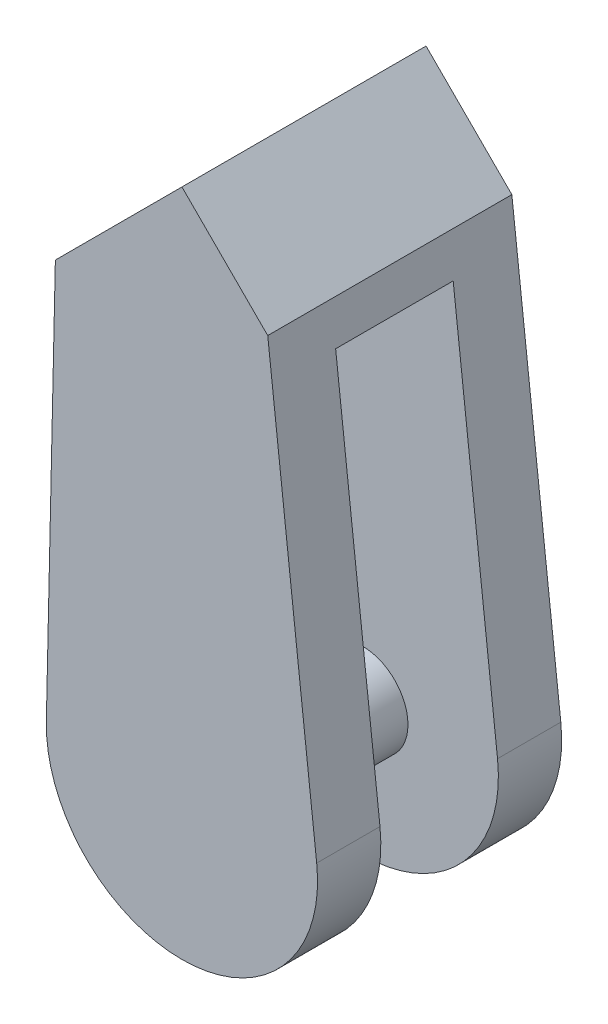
ISO-10303-21;
HEADER;
FILE_DESCRIPTION(('STEP AP214'),'2;1');
FILE_NAME('part.step','',(''),(''),'','','');
FILE_SCHEMA(('AUTOMOTIVE_DESIGN { 1 0 10303 214 1 1 1 1 }'));
ENDSEC;
DATA;
#1=APPLICATION_CONTEXT('core data for automotive mechanical design processes');
#2=APPLICATION_PROTOCOL_DEFINITION('international standard','automotive_design',2000,#1);
#3=PRODUCT_CONTEXT('',#1,'mechanical');
#4=PRODUCT('Part','Part','',(#3));
#5=PRODUCT_RELATED_PRODUCT_CATEGORY('part','',(#4));
#6=PRODUCT_DEFINITION_FORMATION('','',#4);
#7=PRODUCT_DEFINITION_CONTEXT('part definition',#1,'design');
#8=PRODUCT_DEFINITION('design','',#6,#7);
#9=PRODUCT_DEFINITION_SHAPE('','',#8);
#10=(LENGTH_UNIT() NAMED_UNIT(*) SI_UNIT(.MILLI.,.METRE.));
#11=(NAMED_UNIT(*) PLANE_ANGLE_UNIT() SI_UNIT($,.RADIAN.));
#12=(NAMED_UNIT(*) SI_UNIT($,.STERADIAN.) SOLID_ANGLE_UNIT());
#13=UNCERTAINTY_MEASURE_WITH_UNIT(LENGTH_MEASURE(1.E-05),#10,'distance_accuracy_value','');
#14=(GEOMETRIC_REPRESENTATION_CONTEXT(3) GLOBAL_UNCERTAINTY_ASSIGNED_CONTEXT((#13)) GLOBAL_UNIT_ASSIGNED_CONTEXT((#10,
#11,#12)) REPRESENTATION_CONTEXT('',''));
#15=CARTESIAN_POINT('',(0.,0.,0.));
#16=DIRECTION('',(0.,0.,1.));
#17=DIRECTION('',(1.,0.,0.));
#18=AXIS2_PLACEMENT_3D('',#15,#16,#17);
#19=CARTESIAN_POINT('',(-10.,-15.5,-0.65));
#20=DIRECTION('',(0.,0.,1.));
#21=DIRECTION('',(1.,0.,0.));
#22=AXIS2_PLACEMENT_3D('',#19,#20,#21);
#23=PLANE('',#22);
#24=DIRECTION('',(-0.0222995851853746,-0.999751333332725,0.));
#25=VECTOR('',#24,1.);
#26=CARTESIAN_POINT('',(-1.4,4.5,-0.65));
#27=LINE('',#26,#25);
#28=CARTESIAN_POINT('',(-1.4,4.5,-0.65));
#29=VERTEX_POINT('',#28);
#30=CARTESIAN_POINT('',(-1.49962699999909,0.0334493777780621,-0.65));
#31=VERTEX_POINT('',#30);
#32=EDGE_CURVE('E133',#29,#31,#27,.T.);
#33=ORIENTED_EDGE('',*,*,#32,.T.);
#34=CARTESIAN_POINT('',(0.,0.,-0.65));
#35=DIRECTION('',(0.,0.,1.));
#36=DIRECTION('',(1.,0.,0.));
#37=AXIS2_PLACEMENT_3D('',#34,#35,#36);
#38=CIRCLE('',#37,1.5);
#39=CARTESIAN_POINT('',(1.49047378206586,0.168783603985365,-0.65));
#40=VERTEX_POINT('',#39);
#41=EDGE_CURVE('E109',#31,#40,#38,.T.);
#42=ORIENTED_EDGE('',*,*,#41,.T.);
#43=DIRECTION('',(-0.11252240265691,0.993649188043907,0.));
#44=VECTOR('',#43,1.);
#45=CARTESIAN_POINT('',(0.999999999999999,4.5,-0.65));
#46=LINE('',#45,#44);
#47=CARTESIAN_POINT('',(0.999999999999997,4.5,-0.65));
#48=VERTEX_POINT('',#47);
#49=EDGE_CURVE('E37',#40,#48,#46,.T.);
#50=ORIENTED_EDGE('',*,*,#49,.T.);
#51=DIRECTION('',(-1.,0.,0.));
#52=VECTOR('',#51,1.);
#53=CARTESIAN_POINT('',(-10.,4.5,-0.65));
#54=LINE('',#53,#52);
#55=EDGE_CURVE('E120',#48,#29,#54,.T.);
#56=ORIENTED_EDGE('',*,*,#55,.T.);
#57=EDGE_LOOP('',(#33,#42,#50,#56));
#58=FACE_BOUND('',#57,.T.);
#59=CARTESIAN_POINT('',(0.,0.,-0.65));
#60=DIRECTION('',(0.,0.,1.));
#61=DIRECTION('',(1.,0.,0.));
#62=AXIS2_PLACEMENT_3D('',#59,#60,#61);
#63=CIRCLE('',#62,0.5);
#64=CARTESIAN_POINT('',(0.5,0.,-0.65));
#65=VERTEX_POINT('',#64);
#66=EDGE_CURVE('E121',#65,#65,#63,.F.);
#67=ORIENTED_EDGE('',*,*,#66,.T.);
#68=EDGE_LOOP('',(#67));
#69=FACE_BOUND('',#68,.T.);
#70=ADVANCED_FACE('F29',(#58,#69),#23,.T.);
#71=CARTESIAN_POINT('',(-10.,-15.5,0.65));
#72=DIRECTION('',(0.,0.,1.));
#73=DIRECTION('',(1.,0.,0.));
#74=AXIS2_PLACEMENT_3D('',#71,#72,#73);
#75=PLANE('',#74);
#76=DIRECTION('',(-1.,0.,0.));
#77=VECTOR('',#76,1.);
#78=CARTESIAN_POINT('',(-10.,4.5,0.65));
#79=LINE('',#78,#77);
#80=CARTESIAN_POINT('',(0.999999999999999,4.5,0.65));
#81=VERTEX_POINT('',#80);
#82=CARTESIAN_POINT('',(-1.4,4.5,0.65));
#83=VERTEX_POINT('',#82);
#84=EDGE_CURVE('E44',#81,#83,#79,.T.);
#85=ORIENTED_EDGE('',*,*,#84,.F.);
#86=DIRECTION('',(-0.11252240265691,0.993649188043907,0.));
#87=VECTOR('',#86,1.);
#88=CARTESIAN_POINT('',(0.999999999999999,4.5,0.65));
#89=LINE('',#88,#87);
#90=CARTESIAN_POINT('',(1.49047378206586,0.168783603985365,0.65));
#91=VERTEX_POINT('',#90);
#92=EDGE_CURVE('E148',#91,#81,#89,.T.);
#93=ORIENTED_EDGE('',*,*,#92,.F.);
#94=CARTESIAN_POINT('',(0.,0.,0.65));
#95=DIRECTION('',(0.,0.,1.));
#96=DIRECTION('',(1.,0.,0.));
#97=AXIS2_PLACEMENT_3D('',#94,#95,#96);
#98=CIRCLE('',#97,1.5);
#99=CARTESIAN_POINT('',(-1.49962699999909,0.0334493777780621,0.65));
#100=VERTEX_POINT('',#99);
#101=EDGE_CURVE('E104',#100,#91,#98,.T.);
#102=ORIENTED_EDGE('',*,*,#101,.F.);
#103=DIRECTION('',(-0.0222995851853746,-0.999751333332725,0.));
#104=VECTOR('',#103,1.);
#105=CARTESIAN_POINT('',(-1.4,4.5,0.65));
#106=LINE('',#105,#104);
#107=EDGE_CURVE('E100',#83,#100,#106,.T.);
#108=ORIENTED_EDGE('',*,*,#107,.F.);
#109=EDGE_LOOP('',(#85,#93,#102,#108));
#110=FACE_BOUND('',#109,.T.);
#111=CARTESIAN_POINT('',(0.,0.,0.65));
#112=DIRECTION('',(0.,0.,1.));
#113=DIRECTION('',(1.,0.,0.));
#114=AXIS2_PLACEMENT_3D('',#111,#112,#113);
#115=CIRCLE('',#114,0.5);
#116=CARTESIAN_POINT('',(0.5,0.,0.65));
#117=VERTEX_POINT('',#116);
#118=EDGE_CURVE('E11',#117,#117,#115,.F.);
#119=ORIENTED_EDGE('',*,*,#118,.F.);
#120=EDGE_LOOP('',(#119));
#121=FACE_BOUND('',#120,.T.);
#122=ADVANCED_FACE('F101',(#110,#121),#75,.F.);
#123=CARTESIAN_POINT('',(-1.4,4.5,1.35));
#124=DIRECTION('',(0.999751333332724,-0.0222995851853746,0.));
#125=DIRECTION('',(0.0222995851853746,0.999751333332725,0.));
#126=AXIS2_PLACEMENT_3D('',#123,#124,#125);
#127=PLANE('',#126);
#128=ORIENTED_EDGE('',*,*,#32,.F.);
#129=DIRECTION('',(0.,0.,-1.));
#130=VECTOR('',#129,1.);
#131=CARTESIAN_POINT('',(-1.4,4.5,1.35));
#132=LINE('',#131,#130);
#133=CARTESIAN_POINT('',(-1.4,4.5,-1.35));
#134=VERTEX_POINT('',#133);
#135=EDGE_CURVE('E131',#29,#134,#132,.T.);
#136=ORIENTED_EDGE('',*,*,#135,.T.);
#137=DIRECTION('',(-0.0222995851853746,-0.999751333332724,0.));
#138=VECTOR('',#137,1.);
#139=CARTESIAN_POINT('',(-1.4,4.5,-1.35));
#140=LINE('',#139,#138);
#141=CARTESIAN_POINT('',(-1.49962699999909,0.0334493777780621,-1.35));
#142=VERTEX_POINT('',#141);
#143=EDGE_CURVE('E170',#134,#142,#140,.T.);
#144=ORIENTED_EDGE('',*,*,#143,.T.);
#145=DIRECTION('',(0.,0.,-1.));
#146=VECTOR('',#145,1.);
#147=CARTESIAN_POINT('',(-1.49962699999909,0.0334493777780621,1.35));
#148=LINE('',#147,#146);
#149=EDGE_CURVE('E186',#31,#142,#148,.T.);
#150=ORIENTED_EDGE('',*,*,#149,.F.);
#151=EDGE_LOOP('',(#128,#136,#144,#150));
#152=FACE_BOUND('',#151,.T.);
#153=ADVANCED_FACE('F202',(#152),#127,.F.);
#154=CARTESIAN_POINT('',(0.,0.,1.35));
#155=DIRECTION('',(0.,0.,-1.));
#156=DIRECTION('',(-1.,0.,0.));
#157=AXIS2_PLACEMENT_3D('',#154,#155,#156);
#158=CYLINDRICAL_SURFACE('',#157,1.5);
#159=ORIENTED_EDGE('',*,*,#41,.F.);
#160=ORIENTED_EDGE('',*,*,#149,.T.);
#161=CARTESIAN_POINT('',(0.,0.,-1.35));
#162=DIRECTION('',(0.,0.,1.));
#163=DIRECTION('',(1.,0.,0.));
#164=AXIS2_PLACEMENT_3D('',#161,#162,#163);
#165=CIRCLE('',#164,1.5);
#166=CARTESIAN_POINT('',(1.49047378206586,0.168783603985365,-1.35));
#167=VERTEX_POINT('',#166);
#168=EDGE_CURVE('E173',#142,#167,#165,.T.);
#169=ORIENTED_EDGE('',*,*,#168,.T.);
#170=DIRECTION('',(0.,0.,-1.));
#171=VECTOR('',#170,1.);
#172=CARTESIAN_POINT('',(1.49047378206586,0.168783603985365,1.35));
#173=LINE('',#172,#171);
#174=EDGE_CURVE('E185',#40,#167,#173,.T.);
#175=ORIENTED_EDGE('',*,*,#174,.F.);
#176=EDGE_LOOP('',(#159,#160,#169,#175));
#177=FACE_BOUND('',#176,.T.);
#178=ADVANCED_FACE('F191',(#177),#158,.T.);
#179=CARTESIAN_POINT('',(0.999999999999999,4.5,1.35));
#180=DIRECTION('',(-0.993649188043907,-0.11252240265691,0.));
#181=DIRECTION('',(0.11252240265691,-0.993649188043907,0.));
#182=AXIS2_PLACEMENT_3D('',#179,#180,#181);
#183=PLANE('',#182);
#184=ORIENTED_EDGE('',*,*,#49,.F.);
#185=ORIENTED_EDGE('',*,*,#174,.T.);
#186=DIRECTION('',(-0.11252240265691,0.993649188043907,0.));
#187=VECTOR('',#186,1.);
#188=CARTESIAN_POINT('',(0.999999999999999,4.5,-1.35));
#189=LINE('',#188,#187);
#190=CARTESIAN_POINT('',(0.948918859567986,4.95108114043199,-1.35));
#191=VERTEX_POINT('',#190);
#192=EDGE_CURVE('E176',#167,#191,#189,.T.);
#193=ORIENTED_EDGE('',*,*,#192,.T.);
#194=DIRECTION('',(0.,0.,-1.));
#195=VECTOR('',#194,1.);
#196=CARTESIAN_POINT('',(0.948918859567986,4.95108114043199,1.35));
#197=LINE('',#196,#195);
#198=CARTESIAN_POINT('',(0.948918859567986,4.95108114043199,1.35));
#199=VERTEX_POINT('',#198);
#200=EDGE_CURVE('E140',#199,#191,#197,.T.);
#201=ORIENTED_EDGE('',*,*,#200,.F.);
#202=DIRECTION('',(-0.11252240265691,0.993649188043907,0.));
#203=VECTOR('',#202,1.);
#204=CARTESIAN_POINT('',(0.999999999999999,4.5,1.35));
#205=LINE('',#204,#203);
#206=CARTESIAN_POINT('',(1.49047378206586,0.168783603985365,1.35));
#207=VERTEX_POINT('',#206);
#208=EDGE_CURVE('E52',#207,#199,#205,.T.);
#209=ORIENTED_EDGE('',*,*,#208,.F.);
#210=EDGE_CURVE('E159',#207,#91,#173,.T.);
#211=ORIENTED_EDGE('',*,*,#210,.T.);
#212=ORIENTED_EDGE('',*,*,#92,.T.);
#213=DIRECTION('',(0.,0.,-1.));
#214=VECTOR('',#213,1.);
#215=CARTESIAN_POINT('',(0.999999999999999,4.5,1.35));
#216=LINE('',#215,#214);
#217=EDGE_CURVE('E118',#81,#48,#216,.T.);
#218=ORIENTED_EDGE('',*,*,#217,.T.);
#219=EDGE_LOOP('',(#184,#185,#193,#201,#209,#211,#212,#218));
#220=FACE_BOUND('',#219,.T.);
#221=ADVANCED_FACE('F157',(#220),#183,.F.);
#222=CARTESIAN_POINT('',(0.,5.89999999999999,1.35));
#223=DIRECTION('',(-0.707106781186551,-0.707106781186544,0.));
#224=DIRECTION('',(0.707106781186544,-0.707106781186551,0.));
#225=AXIS2_PLACEMENT_3D('',#222,#223,#224);
#226=PLANE('',#225);
#227=DIRECTION('',(-0.707106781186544,0.707106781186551,0.));
#228=VECTOR('',#227,1.);
#229=CARTESIAN_POINT('',(0.,5.89999999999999,-1.35));
#230=LINE('',#229,#228);
#231=CARTESIAN_POINT('',(0.,5.89999999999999,-1.35));
#232=VERTEX_POINT('',#231);
#233=EDGE_CURVE('E132',#191,#232,#230,.T.);
#234=ORIENTED_EDGE('',*,*,#233,.T.);
#235=DIRECTION('',(0.,0.,-1.));
#236=VECTOR('',#235,1.);
#237=CARTESIAN_POINT('',(0.,5.89999999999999,1.35));
#238=LINE('',#237,#236);
#239=CARTESIAN_POINT('',(0.,5.89999999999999,1.35));
#240=VERTEX_POINT('',#239);
#241=EDGE_CURVE('E137',#240,#232,#238,.T.);
#242=ORIENTED_EDGE('',*,*,#241,.F.);
#243=DIRECTION('',(-0.707106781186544,0.707106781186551,0.));
#244=VECTOR('',#243,1.);
#245=CARTESIAN_POINT('',(0.,5.89999999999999,1.35));
#246=LINE('',#245,#244);
#247=EDGE_CURVE('E179',#199,#240,#246,.T.);
#248=ORIENTED_EDGE('',*,*,#247,.F.);
#249=ORIENTED_EDGE('',*,*,#200,.T.);
#250=EDGE_LOOP('',(#234,#242,#248,#249));
#251=FACE_BOUND('',#250,.T.);
#252=ADVANCED_FACE('F31',(#251),#226,.F.);
#253=CARTESIAN_POINT('',(-1.4,4.5,1.35));
#254=DIRECTION('',(0.707106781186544,-0.707106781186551,0.));
#255=DIRECTION('',(0.707106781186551,0.707106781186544,0.));
#256=AXIS2_PLACEMENT_3D('',#253,#254,#255);
#257=PLANE('',#256);
#258=DIRECTION('',(-0.707106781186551,-0.707106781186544,0.));
#259=VECTOR('',#258,1.);
#260=CARTESIAN_POINT('',(-1.4,4.5,-1.35));
#261=LINE('',#260,#259);
#262=EDGE_CURVE('E168',#232,#134,#261,.T.);
#263=ORIENTED_EDGE('',*,*,#262,.T.);
#264=ORIENTED_EDGE('',*,*,#135,.F.);
#265=DIRECTION('',(0.,0.,1.));
#266=VECTOR('',#265,1.);
#267=CARTESIAN_POINT('',(-1.4,4.5,1.35));
#268=LINE('',#267,#266);
#269=EDGE_CURVE('E115',#29,#83,#268,.T.);
#270=ORIENTED_EDGE('',*,*,#269,.T.);
#271=CARTESIAN_POINT('',(-1.4,4.5,1.35));
#272=VERTEX_POINT('',#271);
#273=EDGE_CURVE('E129',#272,#83,#132,.T.);
#274=ORIENTED_EDGE('',*,*,#273,.F.);
#275=DIRECTION('',(-0.707106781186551,-0.707106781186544,0.));
#276=VECTOR('',#275,1.);
#277=CARTESIAN_POINT('',(-1.4,4.5,1.35));
#278=LINE('',#277,#276);
#279=EDGE_CURVE('E181',#240,#272,#278,.T.);
#280=ORIENTED_EDGE('',*,*,#279,.F.);
#281=ORIENTED_EDGE('',*,*,#241,.T.);
#282=EDGE_LOOP('',(#263,#264,#270,#274,#280,#281));
#283=FACE_BOUND('',#282,.T.);
#284=ADVANCED_FACE('F127',(#283),#257,.F.);
#285=ORIENTED_EDGE('',*,*,#273,.T.);
#286=ORIENTED_EDGE('',*,*,#107,.T.);
#287=CARTESIAN_POINT('',(-1.49962699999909,0.0334493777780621,1.35));
#288=VERTEX_POINT('',#287);
#289=EDGE_CURVE('E142',#288,#100,#148,.T.);
#290=ORIENTED_EDGE('',*,*,#289,.F.);
#291=DIRECTION('',(-0.0222995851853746,-0.999751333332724,0.));
#292=VECTOR('',#291,1.);
#293=CARTESIAN_POINT('',(-1.4,4.5,1.35));
#294=LINE('',#293,#292);
#295=EDGE_CURVE('E136',#272,#288,#294,.T.);
#296=ORIENTED_EDGE('',*,*,#295,.F.);
#297=EDGE_LOOP('',(#285,#286,#290,#296));
#298=FACE_BOUND('',#297,.T.);
#299=ADVANCED_FACE('F135',(#298),#127,.F.);
#300=ORIENTED_EDGE('',*,*,#289,.T.);
#301=ORIENTED_EDGE('',*,*,#101,.T.);
#302=ORIENTED_EDGE('',*,*,#210,.F.);
#303=CARTESIAN_POINT('',(0.,0.,1.35));
#304=DIRECTION('',(0.,0.,1.));
#305=DIRECTION('',(1.,0.,0.));
#306=AXIS2_PLACEMENT_3D('',#303,#304,#305);
#307=CIRCLE('',#306,1.5);
#308=EDGE_CURVE('E184',#288,#207,#307,.T.);
#309=ORIENTED_EDGE('',*,*,#308,.F.);
#310=EDGE_LOOP('',(#300,#301,#302,#309));
#311=FACE_BOUND('',#310,.T.);
#312=ADVANCED_FACE('F161',(#311),#158,.T.);
#313=CARTESIAN_POINT('',(0.,0.,1.35));
#314=DIRECTION('',(0.,0.,1.));
#315=DIRECTION('',(1.,0.,0.));
#316=AXIS2_PLACEMENT_3D('',#313,#314,#315);
#317=PLANE('',#316);
#318=ORIENTED_EDGE('',*,*,#208,.T.);
#319=ORIENTED_EDGE('',*,*,#247,.T.);
#320=ORIENTED_EDGE('',*,*,#279,.T.);
#321=ORIENTED_EDGE('',*,*,#295,.T.);
#322=ORIENTED_EDGE('',*,*,#308,.T.);
#323=EDGE_LOOP('',(#318,#319,#320,#321,#322));
#324=FACE_BOUND('',#323,.T.);
#325=ADVANCED_FACE('F200',(#324),#317,.T.);
#326=CARTESIAN_POINT('',(0.,0.,-1.35));
#327=DIRECTION('',(0.,0.,1.));
#328=DIRECTION('',(1.,0.,0.));
#329=AXIS2_PLACEMENT_3D('',#326,#327,#328);
#330=PLANE('',#329);
#331=ORIENTED_EDGE('',*,*,#233,.F.);
#332=ORIENTED_EDGE('',*,*,#192,.F.);
#333=ORIENTED_EDGE('',*,*,#168,.F.);
#334=ORIENTED_EDGE('',*,*,#143,.F.);
#335=ORIENTED_EDGE('',*,*,#262,.F.);
#336=EDGE_LOOP('',(#331,#332,#333,#334,#335));
#337=FACE_BOUND('',#336,.T.);
#338=ADVANCED_FACE('F195',(#337),#330,.F.);
#339=CARTESIAN_POINT('',(-10.,4.5,-0.65));
#340=DIRECTION('',(0.,1.,0.));
#341=DIRECTION('',(0.,0.,1.));
#342=AXIS2_PLACEMENT_3D('',#339,#340,#341);
#343=PLANE('',#342);
#344=ORIENTED_EDGE('',*,*,#55,.F.);
#345=ORIENTED_EDGE('',*,*,#217,.F.);
#346=ORIENTED_EDGE('',*,*,#84,.T.);
#347=ORIENTED_EDGE('',*,*,#269,.F.);
#348=EDGE_LOOP('',(#344,#345,#346,#347));
#349=FACE_BOUND('',#348,.T.);
#350=ADVANCED_FACE('F114',(#349),#343,.F.);
#351=CARTESIAN_POINT('',(0.,0.,1.35));
#352=DIRECTION('',(0.,0.,-1.));
#353=DIRECTION('',(-1.,0.,0.));
#354=AXIS2_PLACEMENT_3D('',#351,#352,#353);
#355=CYLINDRICAL_SURFACE('',#354,0.5);
#356=ORIENTED_EDGE('',*,*,#66,.F.);
#357=EDGE_LOOP('',(#356));
#358=FACE_BOUND('',#357,.T.);
#359=ORIENTED_EDGE('',*,*,#118,.T.);
#360=EDGE_LOOP('',(#359));
#361=FACE_BOUND('',#360,.T.);
#362=ADVANCED_FACE('F220',(#358,#361),#355,.T.);
#363=CLOSED_SHELL('',(#70,#122,#153,#178,#221,#252,#284,#299,#312,#325,#338,#350,#362));
#364=MANIFOLD_SOLID_BREP('B2',#363);
#365=ADVANCED_BREP_SHAPE_REPRESENTATION('',(#18,#364),#14);
#366=SHAPE_DEFINITION_REPRESENTATION(#9,#365);
ENDSEC;
END-ISO-10303-21;
